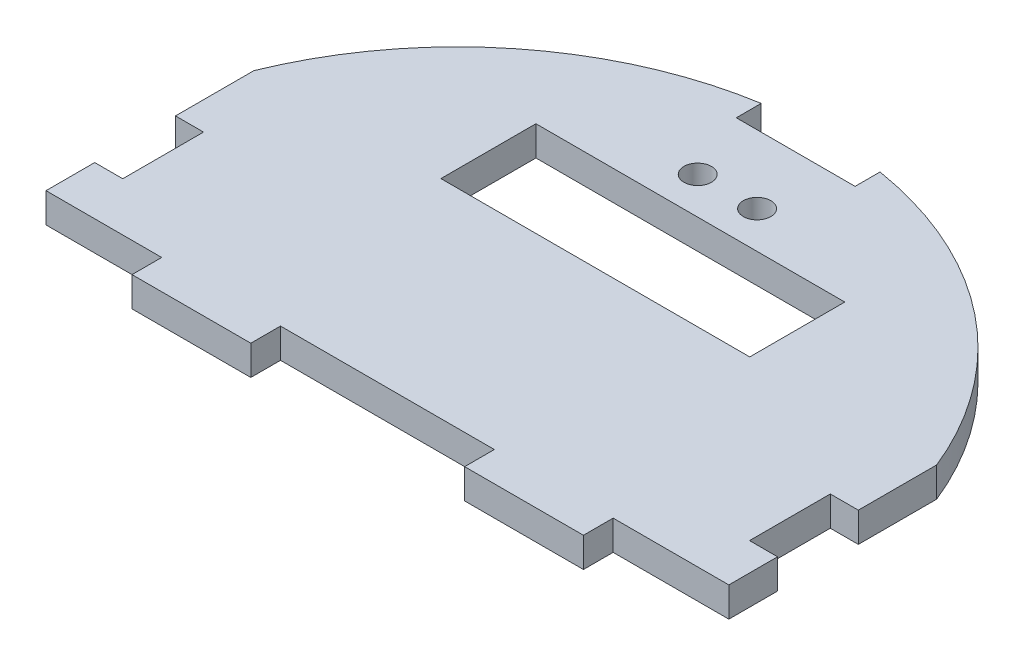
from build123d import *

# Parameters (mm, degrees)
SKETCH1_R      = 1.4732
SKETCH1_W      = 33.02
SKETCH1_H      = 10.16
EXTRUDE1_DEPTH = 3.175


with BuildPart() as part:
    # Sketch1 → Extrude1 (new body)
    with BuildSketch(Plane(origin=(0, 0, 0), x_dir=(1, 0, 0), z_dir=(0, 1, 0))):
        with BuildLine():
            ThreePointArc((-36.5, 10.4), (-24.57738948, 26.388591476), (-6.35, 34.484638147))
            Line((-6.35, 34.484638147), (-6.35, 31.821011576))
            Line((-6.35, 31.821011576), (0, 31.821011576))
            Line((0, 31.821011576), (6.35, 31.821011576))
            Line((6.35, 31.821011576), (6.35, 34.484638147))
            ThreePointArc((6.35, 34.484638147), (24.57738948, 26.388591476), (36.5, 10.4))
            Line((36.5, 10.4), (36.5, 2.018))
            Line((36.5, 2.018), (33.5028, 2.018))
            Line((33.5028, 2.018), (33.5028, -6.618))
            Line((33.5028, -6.618), (36.5, -6.618))
            Line((36.5, -6.618), (36.5, -11.825))
            Line((36.5, -11.825), (33.5028, -11.825))
            Line((33.5028, -11.825), (24.13, -11.825))
            Line((24.13, -11.825), (24.13, -15))
            Line((24.13, -15), (11.43, -15))
            Line((11.43, -15), (11.43, -11.825))
            Line((11.43, -11.825), (-11.43, -11.825))
            Line((-11.43, -11.825), (-11.43, -15))
            Line((-11.43, -15), (-24.13, -15))
            Line((-24.13, -15), (-24.13, -11.825))
            Line((-24.13, -11.825), (-33.5028, -11.825))
            Line((-33.5028, -11.825), (-36.5, -11.825))
            Line((-36.5, -11.825), (-36.5, -6.618))
            Line((-36.5, -6.618), (-33.5028, -6.618))
            Line((-33.5028, -6.618), (-33.5028, 2.018))
            Line((-33.5028, 2.018), (-36.5, 2.018))
            Line((-36.5, 2.018), (-36.5, 10.4))
        make_face()
        with Locations(Location((-3.175, 24.520410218, 0), (0, 0, 270))):
            Circle(SKETCH1_R, mode=Mode.SUBTRACT)
        with Locations(Location((3.175, 24.520410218, 0), (0, 0, 270))):
            Circle(SKETCH1_R, mode=Mode.SUBTRACT)
        with Locations((0, 15.48)):
            Rectangle(SKETCH1_W, SKETCH1_H, mode=Mode.SUBTRACT)
    extrude(amount=EXTRUDE1_DEPTH)


solid = part.part
